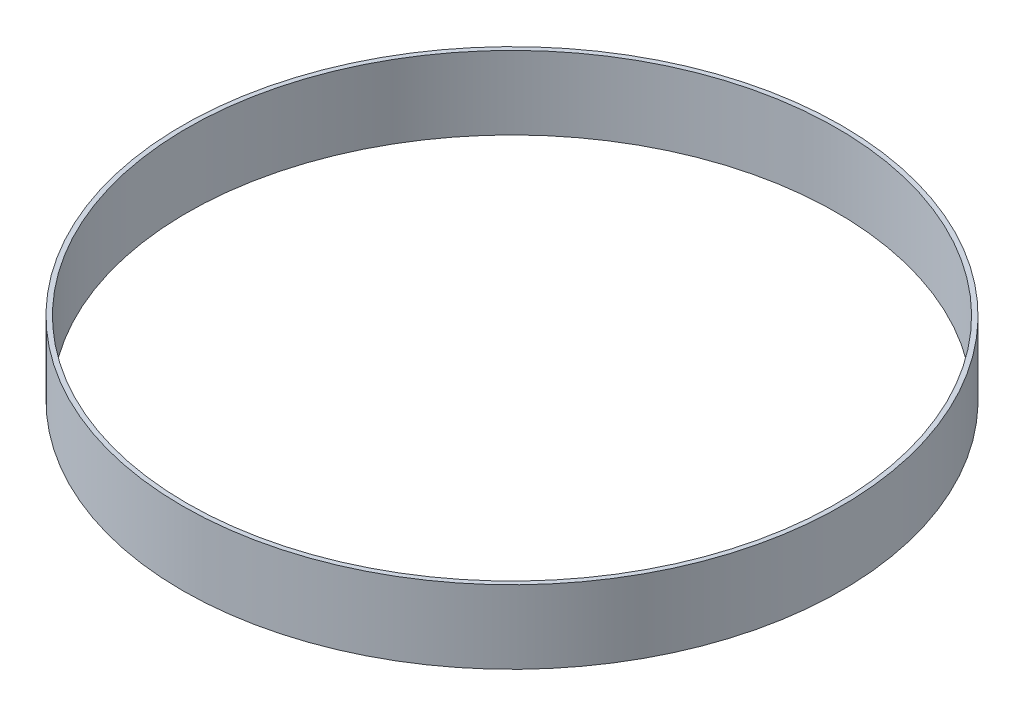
from build123d import *

# Parameters (mm, degrees)
SKETCH1_R      = 457.2
SKETCH1_R_2    = 450.85
EXTRUDE1_DEPTH = 101.6


with BuildPart() as part:
    # Sketch1 → Extrude1 (new body)
    with BuildSketch(Plane(origin=(0, 0, 0), x_dir=(1, 0, 0), z_dir=(0, 1, 0))):
        with Locations(Location((-1.793261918, 0, 0), (0, 0, 270))):
            Circle(SKETCH1_R)
        with Locations(Location((-1.793261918, 0, 0), (0, 0, 270))):
            Circle(SKETCH1_R_2, mode=Mode.SUBTRACT)
    extrude(amount=EXTRUDE1_DEPTH)


solid = part.part
